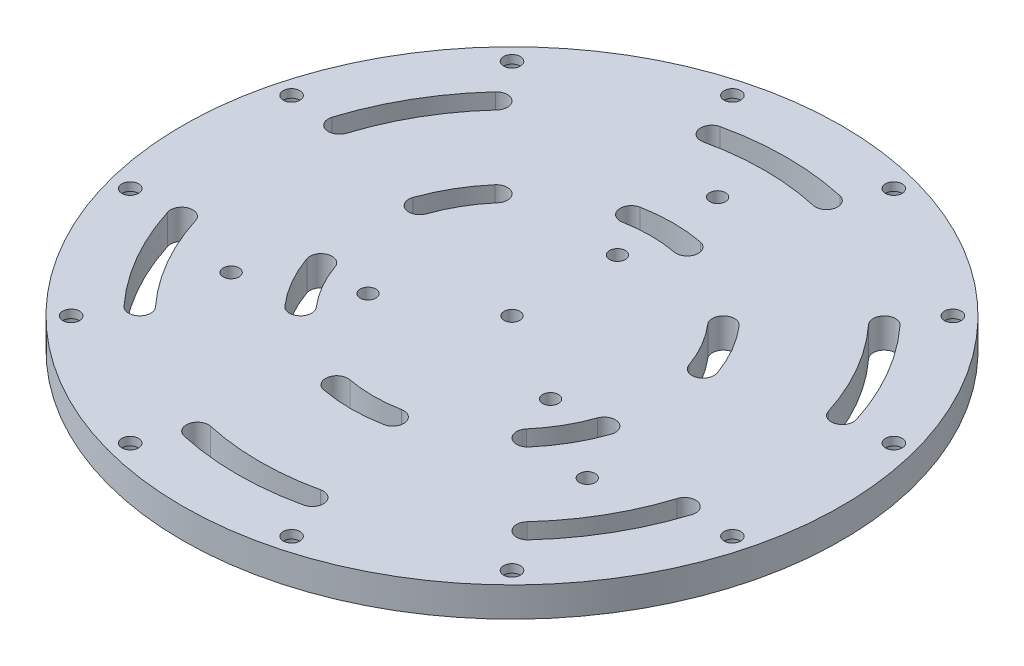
from build123d import *

# Parameters (mm, degrees)
SKETCH1_R                                        = 140.97
BOSS_EXTRUDE1_DEPTH                              = 12.7
CBORE_FOR_1_4_SOCKET_HEAD_CAP_SCREW1_D           = 7.14248
CBORE_FOR_1_4_SOCKET_HEAD_CAP_SCREW1_CBORE_D     = 12.7
CBORE_FOR_1_4_SOCKET_HEAD_CAP_SCREW1_CBORE_DEPTH = 9.144
H_0_266_DIAMETER_HOLE1_D                         = 6.7564
CIRPATTERN1_COUNT                                = 3
CUT_EXTRUDE1_DEPTH                               = 200.765792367
CIRPATTERN2_COUNT                                = 6


with BuildPart() as part:
    # Sketch1 → Boss-Extrude1 (new body)
    with BuildSketch(Plane(origin=(0, 0, 0), x_dir=(1, 0, 0), z_dir=(0, 1, 0))):
        with Locations(Location((0, 0, 0), (0, 0, 270))):
            Circle(SKETCH1_R)
    extrude(amount=BOSS_EXTRUDE1_DEPTH)

    # CBORE for 1_4 Socket Head Cap Screw1 (through all)
    with Locations(Plane(origin=(0, 0, 0), x_dir=(-1, 0, 0), z_dir=(0, -1, 0))):
        with Locations((-128.806208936, -34.513519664), (-94.292689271, 94.292689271), (-34.513519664, 128.806208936), (34.513519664, 128.806208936), (128.806208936, 34.513519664), (128.806208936, -34.513519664), (94.292689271, -94.292689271), (-34.513519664, -128.806208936), (-94.292689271, -94.292689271), (-128.806208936, 34.513519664), (34.513519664, -128.806208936), (94.292689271, 94.292689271)):
            CounterBoreHole(CBORE_FOR_1_4_SOCKET_HEAD_CAP_SCREW1_D / 2, CBORE_FOR_1_4_SOCKET_HEAD_CAP_SCREW1_CBORE_D / 2, CBORE_FOR_1_4_SOCKET_HEAD_CAP_SCREW1_CBORE_DEPTH)

    # H _0.266_ Diameter Hole1 (through all)
    with Locations(Plane(origin=(0, 0, 0), x_dir=(-1, 0, 0), z_dir=(0, -1, 0))):
        with Locations((0, 87.9475), (0, 45.085), (0, 0)):
            h_0_266_diameter_hole1 = Hole(H_0_266_DIAMETER_HOLE1_D / 2)

    # CirPattern1: H _0.266_ Diameter Hole1 ×3 about axis
    cirpattern1_axis = Axis((0, 0, 0), (0, 1, 0))
    for i in range(1, CIRPATTERN1_COUNT):
        add(h_0_266_diameter_hole1.rotate(cirpattern1_axis, i * 360 / CIRPATTERN1_COUNT), mode=Mode.SUBTRACT)

    # Sketch8 → Cut-Extrude1 (cut, through all)
    with BuildSketch(Plane.XZ):
        with BuildLine():
            ThreePointArc((-25.583016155, -114.65550536), (0, -117.475), (25.583016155, -114.65550536))
            ThreePointArc((25.583016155, -114.65550536), (29.194063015, -108.970159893), (23.508717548, -105.359113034))
            ThreePointArc((23.508717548, -105.359113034), (0, -107.95), (-23.508717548, -105.359113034))
            ThreePointArc((-23.508717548, -105.359113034), (-29.194063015, -108.970159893), (-25.583016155, -114.65550536))
        make_face()
        with BuildLine():
            ThreePointArc((-12.840930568, -67.690294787), (0, -68.8975), (12.840930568, -67.690294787))
            ThreePointArc((12.840930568, -67.690294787), (16.632361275, -62.123620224), (11.065686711, -58.332189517))
            ThreePointArc((11.065686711, -58.332189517), (0, -59.3725), (-11.065686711, -58.332189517))
            ThreePointArc((-11.065686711, -58.332189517), (-16.632361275, -62.123620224), (-12.840930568, -67.690294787))
        make_face()
    cut_extrude1 = extrude(amount=-CUT_EXTRUDE1_DEPTH, mode=Mode.SUBTRACT)

    # CirPattern2: Cut-Extrude1 ×6 about axis
    cirpattern2_axis = Axis((0, 0, 0), (0, 1, 0))
    for i in range(1, CIRPATTERN2_COUNT):
        add(cut_extrude1.rotate(cirpattern2_axis, i * 360 / CIRPATTERN2_COUNT), mode=Mode.SUBTRACT)


solid = part.part
